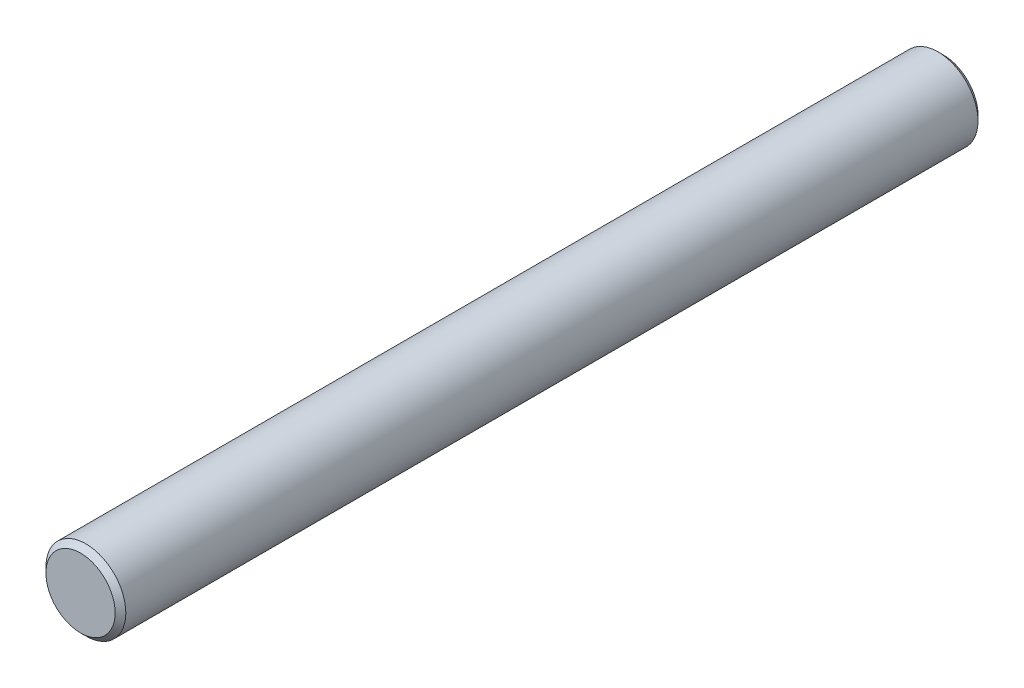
ISO-10303-21;
HEADER;
FILE_DESCRIPTION(('STEP AP214'),'2;1');
FILE_NAME('part.step','',(''),(''),'','','');
FILE_SCHEMA(('AUTOMOTIVE_DESIGN { 1 0 10303 214 1 1 1 1 }'));
ENDSEC;
DATA;
#1=APPLICATION_CONTEXT('core data for automotive mechanical design processes');
#2=APPLICATION_PROTOCOL_DEFINITION('international standard','automotive_design',2000,#1);
#3=PRODUCT_CONTEXT('',#1,'mechanical');
#4=PRODUCT('Part','Part','',(#3));
#5=PRODUCT_RELATED_PRODUCT_CATEGORY('part','',(#4));
#6=PRODUCT_DEFINITION_FORMATION('','',#4);
#7=PRODUCT_DEFINITION_CONTEXT('part definition',#1,'design');
#8=PRODUCT_DEFINITION('design','',#6,#7);
#9=PRODUCT_DEFINITION_SHAPE('','',#8);
#10=(LENGTH_UNIT() NAMED_UNIT(*) SI_UNIT(.MILLI.,.METRE.));
#11=(NAMED_UNIT(*) PLANE_ANGLE_UNIT() SI_UNIT($,.RADIAN.));
#12=(NAMED_UNIT(*) SI_UNIT($,.STERADIAN.) SOLID_ANGLE_UNIT());
#13=UNCERTAINTY_MEASURE_WITH_UNIT(LENGTH_MEASURE(1.E-05),#10,'distance_accuracy_value','');
#14=(GEOMETRIC_REPRESENTATION_CONTEXT(3) GLOBAL_UNCERTAINTY_ASSIGNED_CONTEXT((#13)) GLOBAL_UNIT_ASSIGNED_CONTEXT((#10,
#11,#12)) REPRESENTATION_CONTEXT('',''));
#15=CARTESIAN_POINT('',(0.,0.,0.));
#16=DIRECTION('',(0.,0.,1.));
#17=DIRECTION('',(1.,0.,0.));
#18=AXIS2_PLACEMENT_3D('',#15,#16,#17);
#19=CARTESIAN_POINT('',(0.,0.,32.4));
#20=DIRECTION('',(0.,0.,-1.));
#21=DIRECTION('',(-1.,0.,0.));
#22=AXIS2_PLACEMENT_3D('',#19,#20,#21);
#23=CYLINDRICAL_SURFACE('',#22,1.5);
#24=CARTESIAN_POINT('',(0.,0.,0.199999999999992));
#25=DIRECTION('',(0.,0.,1.));
#26=DIRECTION('',(1.,0.,0.));
#27=AXIS2_PLACEMENT_3D('',#24,#25,#26);
#28=CIRCLE('',#27,1.5);
#29=CARTESIAN_POINT('',(1.5,0.,0.199999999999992));
#30=VERTEX_POINT('',#29);
#31=EDGE_CURVE('E42',#30,#30,#28,.T.);
#32=ORIENTED_EDGE('',*,*,#31,.T.);
#33=EDGE_LOOP('',(#32));
#34=FACE_BOUND('',#33,.T.);
#35=CARTESIAN_POINT('',(0.,0.,32.2));
#36=DIRECTION('',(0.,0.,1.));
#37=DIRECTION('',(1.,0.,0.));
#38=AXIS2_PLACEMENT_3D('',#35,#36,#37);
#39=CIRCLE('',#38,1.5);
#40=CARTESIAN_POINT('',(1.5,0.,32.2));
#41=VERTEX_POINT('',#40);
#42=EDGE_CURVE('E46',#41,#41,#39,.F.);
#43=ORIENTED_EDGE('',*,*,#42,.T.);
#44=EDGE_LOOP('',(#43));
#45=FACE_BOUND('',#44,.T.);
#46=ADVANCED_FACE('F32',(#34,#45),#23,.T.);
#47=CARTESIAN_POINT('',(0.,0.,32.4));
#48=DIRECTION('',(0.,0.,1.));
#49=DIRECTION('',(1.,0.,0.));
#50=AXIS2_PLACEMENT_3D('',#47,#48,#49);
#51=PLANE('',#50);
#52=CARTESIAN_POINT('',(0.,0.,32.4));
#53=DIRECTION('',(0.,0.,1.));
#54=DIRECTION('',(1.,0.,0.));
#55=AXIS2_PLACEMENT_3D('',#52,#53,#54);
#56=CIRCLE('',#55,1.3);
#57=CARTESIAN_POINT('',(1.3,0.,32.4));
#58=VERTEX_POINT('',#57);
#59=EDGE_CURVE('E10',#58,#58,#56,.T.);
#60=ORIENTED_EDGE('',*,*,#59,.T.);
#61=EDGE_LOOP('',(#60));
#62=FACE_BOUND('',#61,.T.);
#63=ADVANCED_FACE('F65',(#62),#51,.T.);
#64=CARTESIAN_POINT('',(0.,0.,0.));
#65=DIRECTION('',(0.,0.,1.));
#66=DIRECTION('',(1.,0.,0.));
#67=AXIS2_PLACEMENT_3D('',#64,#65,#66);
#68=PLANE('',#67);
#69=CARTESIAN_POINT('',(0.,0.,0.));
#70=DIRECTION('',(0.,0.,1.));
#71=DIRECTION('',(1.,0.,0.));
#72=AXIS2_PLACEMENT_3D('',#69,#70,#71);
#73=CIRCLE('',#72,1.30000000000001);
#74=CARTESIAN_POINT('',(1.30000000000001,0.,0.));
#75=VERTEX_POINT('',#74);
#76=EDGE_CURVE('E38',#75,#75,#73,.F.);
#77=ORIENTED_EDGE('',*,*,#76,.T.);
#78=EDGE_LOOP('',(#77));
#79=FACE_BOUND('',#78,.T.);
#80=ADVANCED_FACE('F61',(#79),#68,.F.);
#81=CARTESIAN_POINT('',(0.,0.,0.199999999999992));
#82=DIRECTION('',(0.,0.,1.));
#83=DIRECTION('',(1.,0.,0.));
#84=AXIS2_PLACEMENT_3D('',#81,#82,#83);
#85=CONICAL_SURFACE('',#84,1.5,0.785398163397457);
#86=ORIENTED_EDGE('',*,*,#76,.F.);
#87=EDGE_LOOP('',(#86));
#88=FACE_BOUND('',#87,.T.);
#89=ORIENTED_EDGE('',*,*,#31,.F.);
#90=EDGE_LOOP('',(#89));
#91=FACE_BOUND('',#90,.T.);
#92=ADVANCED_FACE('F56',(#88,#91),#85,.T.);
#93=CARTESIAN_POINT('',(0.,0.,32.4));
#94=DIRECTION('',(0.,0.,-1.));
#95=DIRECTION('',(-1.,0.,0.));
#96=AXIS2_PLACEMENT_3D('',#93,#94,#95);
#97=CONICAL_SURFACE('',#96,1.3,0.785398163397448);
#98=ORIENTED_EDGE('',*,*,#42,.F.);
#99=EDGE_LOOP('',(#98));
#100=FACE_BOUND('',#99,.T.);
#101=ORIENTED_EDGE('',*,*,#59,.F.);
#102=EDGE_LOOP('',(#101));
#103=FACE_BOUND('',#102,.T.);
#104=ADVANCED_FACE('F53',(#100,#103),#97,.T.);
#105=CLOSED_SHELL('',(#46,#63,#80,#92,#104));
#106=MANIFOLD_SOLID_BREP('B2',#105);
#107=ADVANCED_BREP_SHAPE_REPRESENTATION('',(#18,#106),#14);
#108=SHAPE_DEFINITION_REPRESENTATION(#9,#107);
ENDSEC;
END-ISO-10303-21;
